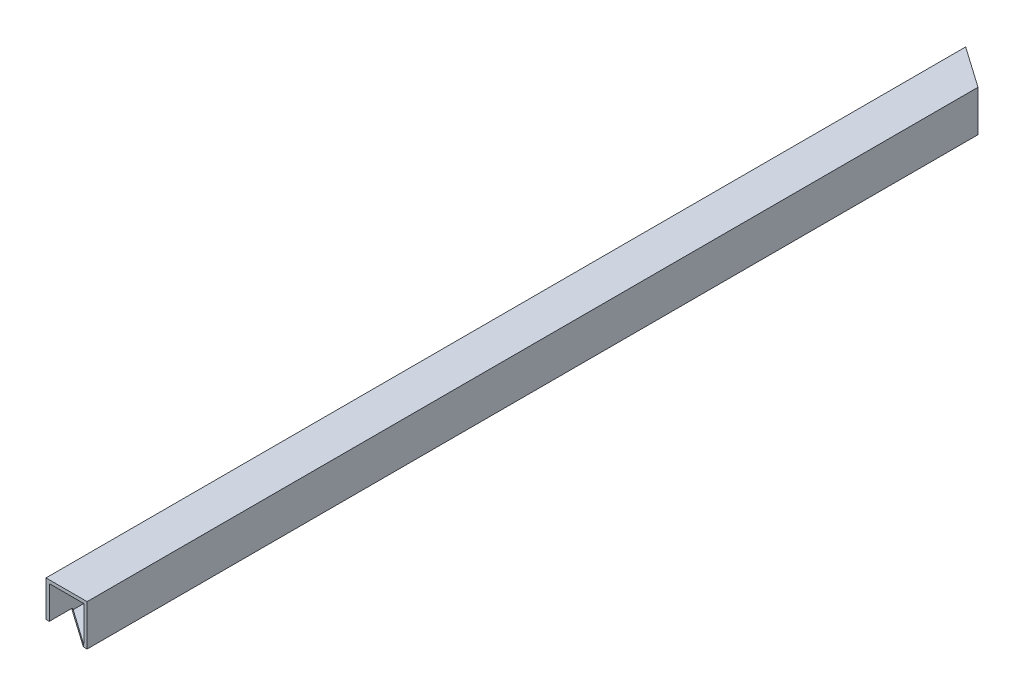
ISO-10303-21;
HEADER;
FILE_DESCRIPTION(('STEP AP214'),'2;1');
FILE_NAME('part.step','',(''),(''),'','','');
FILE_SCHEMA(('AUTOMOTIVE_DESIGN { 1 0 10303 214 1 1 1 1 }'));
ENDSEC;
DATA;
#1=APPLICATION_CONTEXT('core data for automotive mechanical design processes');
#2=APPLICATION_PROTOCOL_DEFINITION('international standard','automotive_design',2000,#1);
#3=PRODUCT_CONTEXT('',#1,'mechanical');
#4=PRODUCT('Part','Part','',(#3));
#5=PRODUCT_RELATED_PRODUCT_CATEGORY('part','',(#4));
#6=PRODUCT_DEFINITION_FORMATION('','',#4);
#7=PRODUCT_DEFINITION_CONTEXT('part definition',#1,'design');
#8=PRODUCT_DEFINITION('design','',#6,#7);
#9=PRODUCT_DEFINITION_SHAPE('','',#8);
#10=(LENGTH_UNIT() NAMED_UNIT(*) SI_UNIT(.MILLI.,.METRE.));
#11=(NAMED_UNIT(*) PLANE_ANGLE_UNIT() SI_UNIT($,.RADIAN.));
#12=(NAMED_UNIT(*) SI_UNIT($,.STERADIAN.) SOLID_ANGLE_UNIT());
#13=UNCERTAINTY_MEASURE_WITH_UNIT(LENGTH_MEASURE(1.E-05),#10,'distance_accuracy_value','');
#14=(GEOMETRIC_REPRESENTATION_CONTEXT(3) GLOBAL_UNCERTAINTY_ASSIGNED_CONTEXT((#13)) GLOBAL_UNIT_ASSIGNED_CONTEXT((#10,
#11,#12)) REPRESENTATION_CONTEXT('',''));
#15=CARTESIAN_POINT('',(0.,0.,0.));
#16=DIRECTION('',(0.,0.,1.));
#17=DIRECTION('',(1.,0.,0.));
#18=AXIS2_PLACEMENT_3D('',#15,#16,#17);
#19=CARTESIAN_POINT('',(-2050.634665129,19.766692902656,-346.0979940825));
#20=DIRECTION('',(0.81912197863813,-0.0163824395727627,0.573385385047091));
#21=DIRECTION('',(-0.0199960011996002,-0.999800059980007,0.));
#22=AXIS2_PLACEMENT_3D('',#19,#20,#21);
#23=CYLINDRICAL_SURFACE('',#22,2.);
#24=CARTESIAN_POINT('',(-21.,-20.82600039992,1074.646271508));
#25=DIRECTION('',(1.,0.,0.));
#26=DIRECTION('',(0.,-0.0285597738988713,0.999592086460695));
#27=AXIS2_PLACEMENT_3D('',#24,#25,#26);
#28=ELLIPSE('',#27,2.441638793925,2.);
#29=CARTESIAN_POINT('',(-21.,-20.82600039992,1072.205120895));
#30=VERTEX_POINT('',#29);
#31=CARTESIAN_POINT('',(-21.,-18.82560043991,1074.618277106));
#32=VERTEX_POINT('',#31);
#33=EDGE_CURVE('E25',#30,#32,#28,.T.);
#34=ORIENTED_EDGE('',*,*,#33,.T.);
#35=DIRECTION('',(0.819121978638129,-0.0163824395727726,0.573385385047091));
#36=VECTOR('',#35,1.);
#37=CARTESIAN_POINT('',(-2050.594673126,21.766293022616,-346.0979940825));
#38=LINE('',#37,#36);
#39=CARTESIAN_POINT('',(-25.,-18.74560043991,1071.818277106));
#40=VERTEX_POINT('',#39);
#41=EDGE_CURVE('E10',#40,#32,#38,.T.);
#42=ORIENTED_EDGE('',*,*,#41,.F.);
#43=CARTESIAN_POINT('',(-25.,-20.74600039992,1071.846271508));
#44=DIRECTION('',(1.,0.,0.));
#45=DIRECTION('',(0.,-0.0285597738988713,0.999592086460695));
#46=AXIS2_PLACEMENT_3D('',#43,#44,#45);
#47=ELLIPSE('',#46,2.441638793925,2.);
#48=CARTESIAN_POINT('',(-25.,-20.74600039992,1069.405120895));
#49=VERTEX_POINT('',#48);
#50=EDGE_CURVE('E191',#49,#40,#47,.T.);
#51=ORIENTED_EDGE('',*,*,#50,.F.);
#52=DIRECTION('',(0.819121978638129,-0.0163824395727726,0.573385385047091));
#53=VECTOR('',#52,1.);
#54=CARTESIAN_POINT('',(-2049.488123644,19.743762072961,-347.7365656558));
#55=LINE('',#54,#53);
#56=EDGE_CURVE('E161',#49,#30,#55,.T.);
#57=ORIENTED_EDGE('',*,*,#56,.T.);
#58=EDGE_LOOP('',(#34,#42,#51,#57));
#59=FACE_BOUND('',#58,.T.);
#60=ADVANCED_FACE('F16',(#59),#23,.F.);
#61=CARTESIAN_POINT('',(-2050.634665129,19.766692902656,-346.0979940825));
#62=DIRECTION('',(0.81912197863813,-0.0163824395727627,0.573385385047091));
#63=DIRECTION('',(-0.0199960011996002,-0.999800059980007,0.));
#64=AXIS2_PLACEMENT_3D('',#61,#62,#63);
#65=CYLINDRICAL_SURFACE('',#64,2.);
#66=CARTESIAN_POINT('',(17.031676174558,-21.58663392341,1101.26844483));
#67=DIRECTION('',(0.,0.,-1.));
#68=DIRECTION('',(0.999800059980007,-0.0199960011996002,0.));
#69=AXIS2_PLACEMENT_3D('',#66,#67,#68);
#70=ELLIPSE('',#69,3.488055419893,2.);
#71=CARTESIAN_POINT('',(20.341153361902,-21.,1101.26844483));
#72=VERTEX_POINT('',#71);
#73=CARTESIAN_POINT('',(20.519034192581,-21.65638108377,1101.26844483));
#74=VERTEX_POINT('',#73);
#75=EDGE_CURVE('E231',#72,#74,#70,.T.);
#76=ORIENTED_EDGE('',*,*,#75,.F.);
#77=CARTESIAN_POINT('',(-12.300019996,-21.,1080.73625751));
#78=DIRECTION('',(0.,1.,0.));
#79=DIRECTION('',(0.819231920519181,0.,0.573462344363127));
#80=AXIS2_PLACEMENT_3D('',#77,#78,#79);
#81=ELLIPSE('',#80,122.08193969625,2.);
#82=CARTESIAN_POINT('',(-12.300019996,-21.,1078.295106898));
#83=VERTEX_POINT('',#82);
#84=EDGE_CURVE('E247',#72,#83,#81,.T.);
#85=ORIENTED_EDGE('',*,*,#84,.T.);
#86=DIRECTION('',(0.819121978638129,-0.0163824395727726,0.573385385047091));
#87=VECTOR('',#86,1.);
#88=CARTESIAN_POINT('',(-2049.488123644,19.743762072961,-347.7365656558));
#89=LINE('',#88,#87);
#90=EDGE_CURVE('E212',#83,#74,#89,.T.);
#91=ORIENTED_EDGE('',*,*,#90,.T.);
#92=EDGE_LOOP('',(#76,#85,#91));
#93=FACE_BOUND('',#92,.T.);
#94=ADVANCED_FACE('F287',(#93),#65,.F.);
#95=CARTESIAN_POINT('',(-2050.594673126,21.766293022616,-346.0979940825));
#96=DIRECTION('',(-0.0199960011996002,-0.999800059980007,0.));
#97=DIRECTION('',(-0.999800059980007,0.0199960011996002,0.));
#98=AXIS2_PLACEMENT_3D('',#95,#96,#97);
#99=PLANE('',#98);
#100=DIRECTION('',(0.,0.,-1.));
#101=VECTOR('',#100,1.);
#102=CARTESIAN_POINT('',(-25.,-18.74560043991,-185.5489970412));
#103=LINE('',#102,#101);
#104=CARTESIAN_POINT('',(-25.,-18.74560043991,1101.26844483));
#105=VERTEX_POINT('',#104);
#106=EDGE_CURVE('E150',#105,#40,#103,.T.);
#107=ORIENTED_EDGE('',*,*,#106,.T.);
#108=ORIENTED_EDGE('',*,*,#41,.T.);
#109=DIRECTION('',(0.,0.,-1.));
#110=VECTOR('',#109,1.);
#111=CARTESIAN_POINT('',(-21.,-18.82560043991,-185.5489970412));
#112=LINE('',#111,#110);
#113=CARTESIAN_POINT('',(-21.,-18.82560043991,1101.26844483));
#114=VERTEX_POINT('',#113);
#115=EDGE_CURVE('E254',#114,#32,#112,.T.);
#116=ORIENTED_EDGE('',*,*,#115,.F.);
#117=DIRECTION('',(-0.999800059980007,0.0199960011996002,0.));
#118=VECTOR('',#117,1.);
#119=CARTESIAN_POINT('',(-1025.489715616,1.264193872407,1101.26844483));
#120=LINE('',#119,#118);
#121=EDGE_CURVE('E169',#114,#105,#120,.T.);
#122=ORIENTED_EDGE('',*,*,#121,.T.);
#123=EDGE_LOOP('',(#107,#108,#116,#122));
#124=FACE_BOUND('',#123,.T.);
#125=ADVANCED_FACE('F270',(#124),#99,.T.);
#126=CARTESIAN_POINT('',(-21.,21.,-25.));
#127=DIRECTION('',(1.,0.,0.));
#128=DIRECTION('',(0.,1.,0.));
#129=AXIS2_PLACEMENT_3D('',#126,#127,#128);
#130=PLANE('',#129);
#131=DIRECTION('',(0.,-1.,0.));
#132=VECTOR('',#131,1.);
#133=CARTESIAN_POINT('',(-21.,10.5,-14.7));
#134=LINE('',#133,#132);
#135=CARTESIAN_POINT('',(-21.,21.,-14.7));
#136=VERTEX_POINT('',#135);
#137=CARTESIAN_POINT('',(-21.,-21.,-14.7));
#138=VERTEX_POINT('',#137);
#139=EDGE_CURVE('E196',#136,#138,#134,.T.);
#140=ORIENTED_EDGE('',*,*,#139,.F.);
#141=DIRECTION('',(0.,0.,1.));
#142=VECTOR('',#141,1.);
#143=CARTESIAN_POINT('',(-21.,21.,-25.));
#144=LINE('',#143,#142);
#145=CARTESIAN_POINT('',(-21.,21.,1101.26844483));
#146=VERTEX_POINT('',#145);
#147=EDGE_CURVE('E258',#136,#146,#144,.T.);
#148=ORIENTED_EDGE('',*,*,#147,.T.);
#149=DIRECTION('',(0.,1.,0.));
#150=VECTOR('',#149,1.);
#151=CARTESIAN_POINT('',(-21.,10.5,1101.26844483));
#152=LINE('',#151,#150);
#153=EDGE_CURVE('E175',#114,#146,#152,.T.);
#154=ORIENTED_EDGE('',*,*,#153,.F.);
#155=ORIENTED_EDGE('',*,*,#115,.T.);
#156=ORIENTED_EDGE('',*,*,#33,.F.);
#157=DIRECTION('',(0.,-0.999902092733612,0.0139930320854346));
#158=VECTOR('',#157,1.);
#159=CARTESIAN_POINT('',(-21.,17.981262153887,1071.662036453));
#160=LINE('',#159,#158);
#161=CARTESIAN_POINT('',(-21.,-21.,1072.207555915));
#162=VERTEX_POINT('',#161);
#163=EDGE_CURVE('E187',#30,#162,#160,.T.);
#164=ORIENTED_EDGE('',*,*,#163,.T.);
#165=DIRECTION('',(0.,0.,1.));
#166=VECTOR('',#165,1.);
#167=CARTESIAN_POINT('',(-21.,-21.,-25.));
#168=LINE('',#167,#166);
#169=EDGE_CURVE('E149',#138,#162,#168,.T.);
#170=ORIENTED_EDGE('',*,*,#169,.F.);
#171=EDGE_LOOP('',(#140,#148,#154,#155,#156,#164,#170));
#172=FACE_BOUND('',#171,.T.);
#173=ADVANCED_FACE('F269',(#172),#130,.T.);
#174=CARTESIAN_POINT('',(21.,21.,-25.));
#175=DIRECTION('',(0.,-1.,0.));
#176=DIRECTION('',(0.,0.,-1.));
#177=AXIS2_PLACEMENT_3D('',#174,#175,#176);
#178=PLANE('',#177);
#179=DIRECTION('',(-0.819231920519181,0.,-0.573462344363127));
#180=VECTOR('',#179,1.);
#181=CARTESIAN_POINT('',(1.174496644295,21.,0.822147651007));
#182=LINE('',#181,#180);
#183=CARTESIAN_POINT('',(21.,21.,14.7));
#184=VERTEX_POINT('',#183);
#185=EDGE_CURVE('E201',#184,#136,#182,.T.);
#186=ORIENTED_EDGE('',*,*,#185,.F.);
#187=DIRECTION('',(0.,0.,1.));
#188=VECTOR('',#187,1.);
#189=CARTESIAN_POINT('',(21.,21.,-25.));
#190=LINE('',#189,#188);
#191=CARTESIAN_POINT('',(21.,21.,1101.26844483));
#192=VERTEX_POINT('',#191);
#193=EDGE_CURVE('E253',#184,#192,#190,.T.);
#194=ORIENTED_EDGE('',*,*,#193,.T.);
#195=DIRECTION('',(1.,0.,0.));
#196=VECTOR('',#195,1.);
#197=CARTESIAN_POINT('',(10.5,21.,1101.26844483));
#198=LINE('',#197,#196);
#199=EDGE_CURVE('E217',#146,#192,#198,.T.);
#200=ORIENTED_EDGE('',*,*,#199,.F.);
#201=ORIENTED_EDGE('',*,*,#147,.F.);
#202=EDGE_LOOP('',(#186,#194,#200,#201));
#203=FACE_BOUND('',#202,.T.);
#204=ADVANCED_FACE('F18',(#203),#178,.T.);
#205=CARTESIAN_POINT('',(21.,-21.,-25.));
#206=DIRECTION('',(-1.,0.,0.));
#207=DIRECTION('',(0.,0.,1.));
#208=AXIS2_PLACEMENT_3D('',#205,#206,#207);
#209=PLANE('',#208);
#210=DIRECTION('',(0.,1.,0.));
#211=VECTOR('',#210,1.);
#212=CARTESIAN_POINT('',(21.,-10.5,14.7));
#213=LINE('',#212,#211);
#214=CARTESIAN_POINT('',(21.,-21.,14.7));
#215=VERTEX_POINT('',#214);
#216=EDGE_CURVE('E195',#215,#184,#213,.T.);
#217=ORIENTED_EDGE('',*,*,#216,.F.);
#218=DIRECTION('',(0.,0.,1.));
#219=VECTOR('',#218,1.);
#220=CARTESIAN_POINT('',(21.,-21.,-25.));
#221=LINE('',#220,#219);
#222=CARTESIAN_POINT('',(21.,-21.,1101.26844483));
#223=VERTEX_POINT('',#222);
#224=EDGE_CURVE('E250',#215,#223,#221,.T.);
#225=ORIENTED_EDGE('',*,*,#224,.T.);
#226=DIRECTION('',(0.,-1.,0.));
#227=VECTOR('',#226,1.);
#228=CARTESIAN_POINT('',(21.,-10.5,1101.26844483));
#229=LINE('',#228,#227);
#230=EDGE_CURVE('E221',#192,#223,#229,.T.);
#231=ORIENTED_EDGE('',*,*,#230,.F.);
#232=ORIENTED_EDGE('',*,*,#193,.F.);
#233=EDGE_LOOP('',(#217,#225,#231,#232));
#234=FACE_BOUND('',#233,.T.);
#235=ADVANCED_FACE('F279',(#234),#209,.T.);
#236=CARTESIAN_POINT('',(-21.,-21.,-25.));
#237=DIRECTION('',(0.,1.,0.));
#238=DIRECTION('',(1.,0.,0.));
#239=AXIS2_PLACEMENT_3D('',#236,#237,#238);
#240=PLANE('',#239);
#241=DIRECTION('',(0.819231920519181,0.,0.573462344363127));
#242=VECTOR('',#241,1.);
#243=CARTESIAN_POINT('',(-12.91946308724,-21.,-9.043624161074));
#244=LINE('',#243,#242);
#245=EDGE_CURVE('E200',#138,#215,#244,.T.);
#246=ORIENTED_EDGE('',*,*,#245,.F.);
#247=ORIENTED_EDGE('',*,*,#169,.T.);
#248=DIRECTION('',(0.819339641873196,0.,0.573308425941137));
#249=VECTOR('',#248,1.);
#250=CARTESIAN_POINT('',(-1293.344475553,-21.,181.92253703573));
#251=LINE('',#250,#249);
#252=EDGE_CURVE('E192',#162,#83,#251,.T.);
#253=ORIENTED_EDGE('',*,*,#252,.T.);
#254=ORIENTED_EDGE('',*,*,#84,.F.);
#255=DIRECTION('',(-1.,0.,0.));
#256=VECTOR('',#255,1.);
#257=CARTESIAN_POINT('',(-10.5,-21.,1101.26844483));
#258=LINE('',#257,#256);
#259=EDGE_CURVE('E227',#223,#72,#258,.T.);
#260=ORIENTED_EDGE('',*,*,#259,.F.);
#261=ORIENTED_EDGE('',*,*,#224,.F.);
#262=EDGE_LOOP('',(#246,#247,#253,#254,#260,#261));
#263=FACE_BOUND('',#262,.T.);
#264=ADVANCED_FACE('F283',(#263),#240,.T.);
#265=CARTESIAN_POINT('',(25.,25.,-25.));
#266=DIRECTION('',(0.,-1.,0.));
#267=DIRECTION('',(0.,0.,-1.));
#268=AXIS2_PLACEMENT_3D('',#265,#266,#267);
#269=PLANE('',#268);
#270=DIRECTION('',(0.,0.,1.));
#271=VECTOR('',#270,1.);
#272=CARTESIAN_POINT('',(-25.,25.,-25.));
#273=LINE('',#272,#271);
#274=CARTESIAN_POINT('',(-25.,25.,-17.5));
#275=VERTEX_POINT('',#274);
#276=CARTESIAN_POINT('',(-25.,25.,1101.26844483));
#277=VERTEX_POINT('',#276);
#278=EDGE_CURVE('E138',#275,#277,#273,.T.);
#279=ORIENTED_EDGE('',*,*,#278,.T.);
#280=DIRECTION('',(1.,0.,0.));
#281=VECTOR('',#280,1.);
#282=CARTESIAN_POINT('',(12.5,25.,1101.26844483));
#283=LINE('',#282,#281);
#284=CARTESIAN_POINT('',(25.,25.,1101.26844483));
#285=VERTEX_POINT('',#284);
#286=EDGE_CURVE('E141',#277,#285,#283,.T.);
#287=ORIENTED_EDGE('',*,*,#286,.T.);
#288=DIRECTION('',(0.,0.,1.));
#289=VECTOR('',#288,1.);
#290=CARTESIAN_POINT('',(25.,25.,-25.));
#291=LINE('',#290,#289);
#292=CARTESIAN_POINT('',(25.,25.,17.5));
#293=VERTEX_POINT('',#292);
#294=EDGE_CURVE('E178',#293,#285,#291,.T.);
#295=ORIENTED_EDGE('',*,*,#294,.F.);
#296=DIRECTION('',(-0.819231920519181,0.,-0.573462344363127));
#297=VECTOR('',#296,1.);
#298=CARTESIAN_POINT('',(2.51677852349,25.,1.761744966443));
#299=LINE('',#298,#297);
#300=EDGE_CURVE('E144',#293,#275,#299,.T.);
#301=ORIENTED_EDGE('',*,*,#300,.T.);
#302=EDGE_LOOP('',(#279,#287,#295,#301));
#303=FACE_BOUND('',#302,.T.);
#304=ADVANCED_FACE('F140',(#303),#269,.F.);
#305=CARTESIAN_POINT('',(-25.,25.,-25.));
#306=DIRECTION('',(1.,0.,0.));
#307=DIRECTION('',(0.,1.,0.));
#308=AXIS2_PLACEMENT_3D('',#305,#306,#307);
#309=PLANE('',#308);
#310=DIRECTION('',(0.,0.,1.));
#311=VECTOR('',#310,1.);
#312=CARTESIAN_POINT('',(-25.,-25.,-25.));
#313=LINE('',#312,#311);
#314=CARTESIAN_POINT('',(-25.,-25.,-17.5));
#315=VERTEX_POINT('',#314);
#316=CARTESIAN_POINT('',(-25.,-25.,1069.464653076));
#317=VERTEX_POINT('',#316);
#318=EDGE_CURVE('E299',#315,#317,#313,.T.);
#319=ORIENTED_EDGE('',*,*,#318,.T.);
#320=DIRECTION('',(0.,-0.999902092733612,0.0139930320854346));
#321=VECTOR('',#320,1.);
#322=CARTESIAN_POINT('',(-25.,19.941709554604,1068.835720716));
#323=LINE('',#322,#321);
#324=EDGE_CURVE('E204',#49,#317,#323,.T.);
#325=ORIENTED_EDGE('',*,*,#324,.F.);
#326=ORIENTED_EDGE('',*,*,#50,.T.);
#327=ORIENTED_EDGE('',*,*,#106,.F.);
#328=DIRECTION('',(0.,1.,0.));
#329=VECTOR('',#328,1.);
#330=CARTESIAN_POINT('',(-25.,12.5,1101.26844483));
#331=LINE('',#330,#329);
#332=EDGE_CURVE('E156',#105,#277,#331,.T.);
#333=ORIENTED_EDGE('',*,*,#332,.T.);
#334=ORIENTED_EDGE('',*,*,#278,.F.);
#335=DIRECTION('',(0.,-1.,0.));
#336=VECTOR('',#335,1.);
#337=CARTESIAN_POINT('',(-25.,12.5,-17.5));
#338=LINE('',#337,#336);
#339=EDGE_CURVE('E186',#275,#315,#338,.T.);
#340=ORIENTED_EDGE('',*,*,#339,.T.);
#341=EDGE_LOOP('',(#319,#325,#326,#327,#333,#334,#340));
#342=FACE_BOUND('',#341,.T.);
#343=ADVANCED_FACE('F165',(#342),#309,.F.);
#344=CARTESIAN_POINT('',(-2050.287963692,-20.24824032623,-347.7365656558));
#345=DIRECTION('',(-0.573270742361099,0.011465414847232,0.819285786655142));
#346=DIRECTION('',(0.0199960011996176,0.999800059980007,0.));
#347=AXIS2_PLACEMENT_3D('',#344,#345,#346);
#348=PLANE('',#347);
#349=ORIENTED_EDGE('',*,*,#56,.F.);
#350=ORIENTED_EDGE('',*,*,#324,.T.);
#351=DIRECTION('',(0.819339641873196,0.,0.573308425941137));
#352=VECTOR('',#351,1.);
#353=CARTESIAN_POINT('',(-1294.713405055,-25.,181.02064714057));
#354=LINE('',#353,#352);
#355=CARTESIAN_POINT('',(20.452161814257,-25.,1101.26844483));
#356=VERTEX_POINT('',#355);
#357=EDGE_CURVE('E293',#317,#356,#354,.T.);
#358=ORIENTED_EDGE('',*,*,#357,.T.);
#359=DIRECTION('',(0.0199960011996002,0.999800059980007,0.));
#360=VECTOR('',#359,1.);
#361=CARTESIAN_POINT('',(20.331489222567,-31.03362958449,1101.26844483));
#362=LINE('',#361,#360);
#363=EDGE_CURVE('E162',#356,#74,#362,.T.);
#364=ORIENTED_EDGE('',*,*,#363,.T.);
#365=ORIENTED_EDGE('',*,*,#90,.F.);
#366=ORIENTED_EDGE('',*,*,#252,.F.);
#367=ORIENTED_EDGE('',*,*,#163,.F.);
#368=EDGE_LOOP('',(#349,#350,#358,#364,#365,#366,#367));
#369=FACE_BOUND('',#368,.T.);
#370=ADVANCED_FACE('F291',(#369),#348,.T.);
#371=CARTESIAN_POINT('',(0.,0.,1101.26844483));
#372=DIRECTION('',(0.,0.,-1.));
#373=DIRECTION('',(0.,-1.,0.));
#374=AXIS2_PLACEMENT_3D('',#371,#372,#373);
#375=PLANE('',#374);
#376=ORIENTED_EDGE('',*,*,#332,.F.);
#377=ORIENTED_EDGE('',*,*,#121,.F.);
#378=ORIENTED_EDGE('',*,*,#153,.T.);
#379=ORIENTED_EDGE('',*,*,#199,.T.);
#380=ORIENTED_EDGE('',*,*,#230,.T.);
#381=ORIENTED_EDGE('',*,*,#259,.T.);
#382=ORIENTED_EDGE('',*,*,#75,.T.);
#383=ORIENTED_EDGE('',*,*,#363,.F.);
#384=DIRECTION('',(-1.,0.,0.));
#385=VECTOR('',#384,1.);
#386=CARTESIAN_POINT('',(-12.5,-25.,1101.26844483));
#387=LINE('',#386,#385);
#388=CARTESIAN_POINT('',(25.,-25.,1101.26844483));
#389=VERTEX_POINT('',#388);
#390=EDGE_CURVE('E300',#389,#356,#387,.T.);
#391=ORIENTED_EDGE('',*,*,#390,.F.);
#392=DIRECTION('',(0.,-1.,0.));
#393=VECTOR('',#392,1.);
#394=CARTESIAN_POINT('',(25.,-12.5,1101.26844483));
#395=LINE('',#394,#393);
#396=EDGE_CURVE('E158',#285,#389,#395,.T.);
#397=ORIENTED_EDGE('',*,*,#396,.F.);
#398=ORIENTED_EDGE('',*,*,#286,.F.);
#399=EDGE_LOOP('',(#376,#377,#378,#379,#380,#381,#382,#383,#391,#397,#398));
#400=FACE_BOUND('',#399,.T.);
#401=ADVANCED_FACE('F154',(#400),#375,.F.);
#402=CARTESIAN_POINT('',(25.,-25.,-25.));
#403=DIRECTION('',(-1.,0.,0.));
#404=DIRECTION('',(0.,0.,1.));
#405=AXIS2_PLACEMENT_3D('',#402,#403,#404);
#406=PLANE('',#405);
#407=ORIENTED_EDGE('',*,*,#294,.T.);
#408=ORIENTED_EDGE('',*,*,#396,.T.);
#409=DIRECTION('',(0.,0.,1.));
#410=VECTOR('',#409,1.);
#411=CARTESIAN_POINT('',(25.,-25.,-25.));
#412=LINE('',#411,#410);
#413=CARTESIAN_POINT('',(25.,-25.,17.5));
#414=VERTEX_POINT('',#413);
#415=EDGE_CURVE('E306',#414,#389,#412,.T.);
#416=ORIENTED_EDGE('',*,*,#415,.F.);
#417=DIRECTION('',(0.,1.,0.));
#418=VECTOR('',#417,1.);
#419=CARTESIAN_POINT('',(25.,-12.5,17.5));
#420=LINE('',#419,#418);
#421=EDGE_CURVE('E183',#414,#293,#420,.T.);
#422=ORIENTED_EDGE('',*,*,#421,.T.);
#423=EDGE_LOOP('',(#407,#408,#416,#422));
#424=FACE_BOUND('',#423,.T.);
#425=ADVANCED_FACE('F325',(#424),#406,.F.);
#426=CARTESIAN_POINT('',(0.,0.,0.));
#427=DIRECTION('',(-0.573462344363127,0.,0.819231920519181));
#428=DIRECTION('',(0.,1.,0.));
#429=AXIS2_PLACEMENT_3D('',#426,#427,#428);
#430=PLANE('',#429);
#431=ORIENTED_EDGE('',*,*,#216,.T.);
#432=ORIENTED_EDGE('',*,*,#185,.T.);
#433=ORIENTED_EDGE('',*,*,#139,.T.);
#434=ORIENTED_EDGE('',*,*,#245,.T.);
#435=EDGE_LOOP('',(#431,#432,#433,#434));
#436=FACE_BOUND('',#435,.T.);
#437=ORIENTED_EDGE('',*,*,#300,.F.);
#438=ORIENTED_EDGE('',*,*,#421,.F.);
#439=DIRECTION('',(0.819231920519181,0.,0.573462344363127));
#440=VECTOR('',#439,1.);
#441=CARTESIAN_POINT('',(-14.26174496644,-25.,-9.98322147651));
#442=LINE('',#441,#440);
#443=EDGE_CURVE('E316',#315,#414,#442,.T.);
#444=ORIENTED_EDGE('',*,*,#443,.F.);
#445=ORIENTED_EDGE('',*,*,#339,.F.);
#446=EDGE_LOOP('',(#437,#438,#444,#445));
#447=FACE_BOUND('',#446,.T.);
#448=ADVANCED_FACE('F322',(#436,#447),#430,.F.);
#449=CARTESIAN_POINT('',(-25.,-25.,-25.));
#450=DIRECTION('',(0.,1.,0.));
#451=DIRECTION('',(1.,0.,0.));
#452=AXIS2_PLACEMENT_3D('',#449,#450,#451);
#453=PLANE('',#452);
#454=ORIENTED_EDGE('',*,*,#415,.T.);
#455=ORIENTED_EDGE('',*,*,#390,.T.);
#456=ORIENTED_EDGE('',*,*,#357,.F.);
#457=ORIENTED_EDGE('',*,*,#318,.F.);
#458=ORIENTED_EDGE('',*,*,#443,.T.);
#459=EDGE_LOOP('',(#454,#455,#456,#457,#458));
#460=FACE_BOUND('',#459,.T.);
#461=ADVANCED_FACE('F303',(#460),#453,.F.);
#462=CLOSED_SHELL('',(#60,#94,#125,#173,#204,#235,#264,#304,#343,#370,#401,#425,#448,#461));
#463=MANIFOLD_SOLID_BREP('B1',#462);
#464=ADVANCED_BREP_SHAPE_REPRESENTATION('',(#18,#463),#14);
#465=SHAPE_DEFINITION_REPRESENTATION(#9,#464);
ENDSEC;
END-ISO-10303-21;
